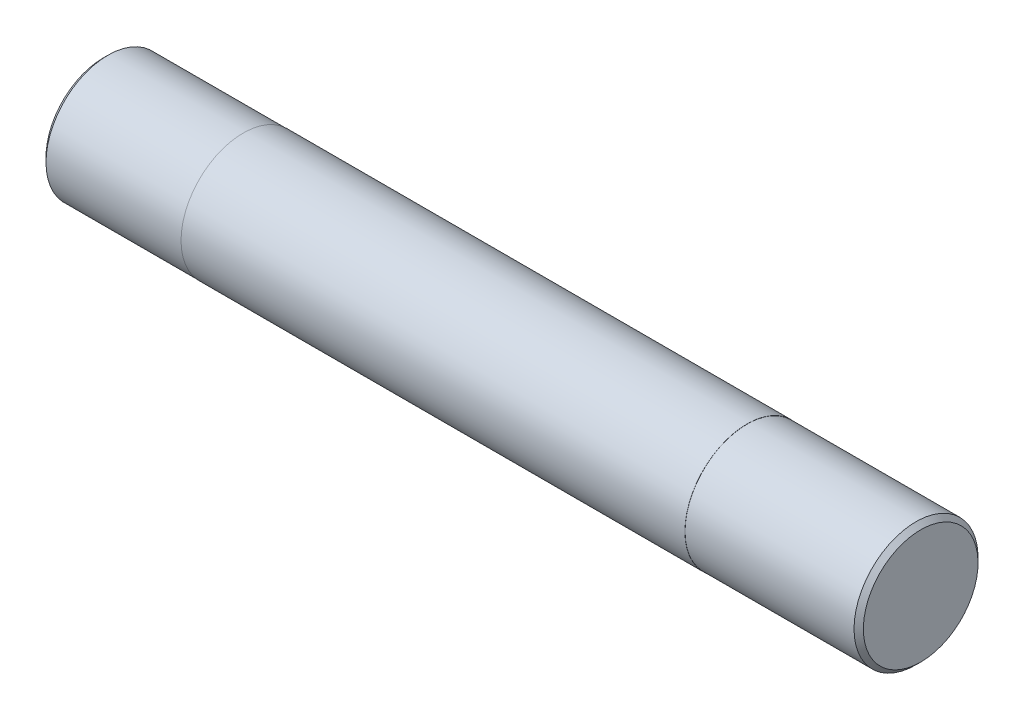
ISO-10303-21;
HEADER;
FILE_DESCRIPTION(('STEP AP214'),'2;1');
FILE_NAME('part.step','',(''),(''),'','','');
FILE_SCHEMA(('AUTOMOTIVE_DESIGN { 1 0 10303 214 1 1 1 1 }'));
ENDSEC;
DATA;
#1=APPLICATION_CONTEXT('core data for automotive mechanical design processes');
#2=APPLICATION_PROTOCOL_DEFINITION('international standard','automotive_design',2000,#1);
#3=PRODUCT_CONTEXT('',#1,'mechanical');
#4=PRODUCT('Part','Part','',(#3));
#5=PRODUCT_RELATED_PRODUCT_CATEGORY('part','',(#4));
#6=PRODUCT_DEFINITION_FORMATION('','',#4);
#7=PRODUCT_DEFINITION_CONTEXT('part definition',#1,'design');
#8=PRODUCT_DEFINITION('design','',#6,#7);
#9=PRODUCT_DEFINITION_SHAPE('','',#8);
#10=(LENGTH_UNIT() NAMED_UNIT(*) SI_UNIT(.MILLI.,.METRE.));
#11=(NAMED_UNIT(*) PLANE_ANGLE_UNIT() SI_UNIT($,.RADIAN.));
#12=(NAMED_UNIT(*) SI_UNIT($,.STERADIAN.) SOLID_ANGLE_UNIT());
#13=UNCERTAINTY_MEASURE_WITH_UNIT(LENGTH_MEASURE(1.E-05),#10,'distance_accuracy_value','');
#14=(GEOMETRIC_REPRESENTATION_CONTEXT(3) GLOBAL_UNCERTAINTY_ASSIGNED_CONTEXT((#13)) GLOBAL_UNIT_ASSIGNED_CONTEXT((#10,
#11,#12)) REPRESENTATION_CONTEXT('',''));
#15=CARTESIAN_POINT('',(0.,0.,0.));
#16=DIRECTION('',(0.,0.,1.));
#17=DIRECTION('',(1.,0.,0.));
#18=AXIS2_PLACEMENT_3D('',#15,#16,#17);
#19=CARTESIAN_POINT('',(-26.2999999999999,3.98999999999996,0.));
#20=DIRECTION('',(1.,0.,0.));
#21=DIRECTION('',(0.,0.,-1.));
#22=AXIS2_PLACEMENT_3D('',#19,#20,#21);
#23=PLANE('',#22);
#24=CARTESIAN_POINT('',(-26.2999999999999,0.,0.));
#25=DIRECTION('',(1.,0.,0.));
#26=DIRECTION('',(0.,1.,0.));
#27=AXIS2_PLACEMENT_3D('',#24,#25,#26);
#28=CIRCLE('',#27,3.68999999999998);
#29=CARTESIAN_POINT('',(-26.2999999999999,3.68999999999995,0.));
#30=VERTEX_POINT('',#29);
#31=EDGE_CURVE('E362',#30,#30,#28,.F.);
#32=ORIENTED_EDGE('',*,*,#31,.T.);
#33=EDGE_LOOP('',(#32));
#34=FACE_BOUND('',#33,.T.);
#35=ADVANCED_FACE('F356',(#34),#23,.F.);
#36=CARTESIAN_POINT('',(-19.9999999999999,0.,0.));
#37=DIRECTION('',(-1.,0.,0.));
#38=DIRECTION('',(0.,0.,1.));
#39=AXIS2_PLACEMENT_3D('',#36,#37,#38);
#40=CYLINDRICAL_SURFACE('',#39,3.98999999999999);
#41=CARTESIAN_POINT('',(-25.9999999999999,0.,0.));
#42=DIRECTION('',(1.,0.,0.));
#43=DIRECTION('',(0.,1.,0.));
#44=AXIS2_PLACEMENT_3D('',#41,#42,#43);
#45=CIRCLE('',#44,3.98999999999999);
#46=CARTESIAN_POINT('',(-25.9999999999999,3.98999999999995,0.));
#47=VERTEX_POINT('',#46);
#48=EDGE_CURVE('E12',#47,#47,#45,.T.);
#49=ORIENTED_EDGE('',*,*,#48,.T.);
#50=EDGE_LOOP('',(#49));
#51=FACE_BOUND('',#50,.T.);
#52=CARTESIAN_POINT('',(-17.3,0.,0.));
#53=DIRECTION('',(-1.,0.,0.));
#54=DIRECTION('',(0.,0.,1.));
#55=AXIS2_PLACEMENT_3D('',#52,#53,#54);
#56=CIRCLE('',#55,3.98999999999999);
#57=CARTESIAN_POINT('',(-17.3,0.,3.99000000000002));
#58=VERTEX_POINT('',#57);
#59=EDGE_CURVE('E375',#58,#58,#56,.T.);
#60=ORIENTED_EDGE('',*,*,#59,.T.);
#61=EDGE_LOOP('',(#60));
#62=FACE_BOUND('',#61,.T.);
#63=ADVANCED_FACE('F406',(#51,#62),#40,.T.);
#64=CARTESIAN_POINT('',(-17.3,3.99999999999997,0.));
#65=DIRECTION('',(1.,0.,0.));
#66=DIRECTION('',(0.,0.,-1.));
#67=AXIS2_PLACEMENT_3D('',#64,#65,#66);
#68=PLANE('',#67);
#69=ORIENTED_EDGE('',*,*,#59,.F.);
#70=EDGE_LOOP('',(#69));
#71=FACE_BOUND('',#70,.T.);
#72=CARTESIAN_POINT('',(-17.3,0.,0.));
#73=DIRECTION('',(-1.,0.,0.));
#74=DIRECTION('',(0.,0.,1.));
#75=AXIS2_PLACEMENT_3D('',#72,#73,#74);
#76=CIRCLE('',#75,4.);
#77=CARTESIAN_POINT('',(-17.3,0.,4.00000000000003));
#78=VERTEX_POINT('',#77);
#79=EDGE_CURVE('E378',#78,#78,#76,.T.);
#80=ORIENTED_EDGE('',*,*,#79,.T.);
#81=EDGE_LOOP('',(#80));
#82=FACE_BOUND('',#81,.T.);
#83=ADVANCED_FACE('F410',(#71,#82),#68,.F.);
#84=CARTESIAN_POINT('',(-19.9999999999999,0.,0.));
#85=DIRECTION('',(-1.,0.,0.));
#86=DIRECTION('',(0.,0.,1.));
#87=AXIS2_PLACEMENT_3D('',#84,#85,#86);
#88=CYLINDRICAL_SURFACE('',#87,4.);
#89=ORIENTED_EDGE('',*,*,#79,.F.);
#90=EDGE_LOOP('',(#89));
#91=FACE_BOUND('',#90,.T.);
#92=CARTESIAN_POINT('',(15.125799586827,0.,0.));
#93=DIRECTION('',(-1.,0.,0.));
#94=DIRECTION('',(0.,0.,1.));
#95=AXIS2_PLACEMENT_3D('',#92,#93,#94);
#96=CIRCLE('',#95,4.);
#97=CARTESIAN_POINT('',(15.125799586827,0.,4.00000000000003));
#98=VERTEX_POINT('',#97);
#99=EDGE_CURVE('E381',#98,#98,#96,.T.);
#100=ORIENTED_EDGE('',*,*,#99,.T.);
#101=EDGE_LOOP('',(#100));
#102=FACE_BOUND('',#101,.T.);
#103=ADVANCED_FACE('F402',(#91,#102),#88,.T.);
#104=CARTESIAN_POINT('',(15.1257344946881,0.,0.));
#105=DIRECTION('',(1.,0.,0.));
#106=DIRECTION('',(0.,0.,-1.));
#107=AXIS2_PLACEMENT_3D('',#104,#105,#106);
#108=CONICAL_SURFACE('',#107,3.99,1.56428720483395);
#109=ORIENTED_EDGE('',*,*,#99,.F.);
#110=EDGE_LOOP('',(#109));
#111=FACE_BOUND('',#110,.T.);
#112=CARTESIAN_POINT('',(15.1257344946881,0.,0.));
#113=DIRECTION('',(-1.,0.,0.));
#114=DIRECTION('',(0.,0.,1.));
#115=AXIS2_PLACEMENT_3D('',#112,#113,#114);
#116=CIRCLE('',#115,3.99);
#117=CARTESIAN_POINT('',(15.1257344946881,0.,3.99000000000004));
#118=VERTEX_POINT('',#117);
#119=EDGE_CURVE('E384',#118,#118,#116,.T.);
#120=ORIENTED_EDGE('',*,*,#119,.T.);
#121=EDGE_LOOP('',(#120));
#122=FACE_BOUND('',#121,.T.);
#123=ADVANCED_FACE('F388',(#111,#122),#108,.F.);
#124=CARTESIAN_POINT('',(-19.9999999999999,0.,0.));
#125=DIRECTION('',(-1.,0.,0.));
#126=DIRECTION('',(0.,0.,1.));
#127=AXIS2_PLACEMENT_3D('',#124,#125,#126);
#128=CYLINDRICAL_SURFACE('',#127,3.99);
#129=CARTESIAN_POINT('',(26.,0.,0.));
#130=DIRECTION('',(-1.,0.,0.));
#131=DIRECTION('',(0.,-1.,0.));
#132=AXIS2_PLACEMENT_3D('',#129,#130,#131);
#133=CIRCLE('',#132,3.99);
#134=CARTESIAN_POINT('',(26.,-3.99,0.));
#135=VERTEX_POINT('',#134);
#136=EDGE_CURVE('E370',#135,#135,#133,.T.);
#137=ORIENTED_EDGE('',*,*,#136,.T.);
#138=EDGE_LOOP('',(#137));
#139=FACE_BOUND('',#138,.T.);
#140=ORIENTED_EDGE('',*,*,#119,.F.);
#141=EDGE_LOOP('',(#140));
#142=FACE_BOUND('',#141,.T.);
#143=ADVANCED_FACE('F390',(#139,#142),#128,.T.);
#144=CARTESIAN_POINT('',(26.3,3.99000000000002,0.));
#145=DIRECTION('',(-1.,0.,0.));
#146=DIRECTION('',(0.,0.,1.));
#147=AXIS2_PLACEMENT_3D('',#144,#145,#146);
#148=PLANE('',#147);
#149=CARTESIAN_POINT('',(26.3,0.,0.));
#150=DIRECTION('',(-1.,0.,0.));
#151=DIRECTION('',(0.,-1.,0.));
#152=AXIS2_PLACEMENT_3D('',#149,#150,#151);
#153=CIRCLE('',#152,3.69);
#154=CARTESIAN_POINT('',(26.3,-3.69,0.));
#155=VERTEX_POINT('',#154);
#156=EDGE_CURVE('E366',#155,#155,#153,.F.);
#157=ORIENTED_EDGE('',*,*,#156,.T.);
#158=EDGE_LOOP('',(#157));
#159=FACE_BOUND('',#158,.T.);
#160=ADVANCED_FACE('F392',(#159),#148,.F.);
#161=CARTESIAN_POINT('',(26.,0.,0.));
#162=DIRECTION('',(-1.,0.,0.));
#163=DIRECTION('',(0.,-1.,0.));
#164=AXIS2_PLACEMENT_3D('',#161,#162,#163);
#165=CONICAL_SURFACE('',#164,3.99,0.785398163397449);
#166=ORIENTED_EDGE('',*,*,#156,.F.);
#167=EDGE_LOOP('',(#166));
#168=FACE_BOUND('',#167,.T.);
#169=ORIENTED_EDGE('',*,*,#136,.F.);
#170=EDGE_LOOP('',(#169));
#171=FACE_BOUND('',#170,.T.);
#172=ADVANCED_FACE('F399',(#168,#171),#165,.T.);
#173=CARTESIAN_POINT('',(-26.2999999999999,0.,0.));
#174=DIRECTION('',(1.,0.,0.));
#175=DIRECTION('',(0.,1.,0.));
#176=AXIS2_PLACEMENT_3D('',#173,#174,#175);
#177=CONICAL_SURFACE('',#176,3.68999999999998,0.785398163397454);
#178=ORIENTED_EDGE('',*,*,#48,.F.);
#179=EDGE_LOOP('',(#178));
#180=FACE_BOUND('',#179,.T.);
#181=ORIENTED_EDGE('',*,*,#31,.F.);
#182=EDGE_LOOP('',(#181));
#183=FACE_BOUND('',#182,.T.);
#184=ADVANCED_FACE('F437',(#180,#183),#177,.T.);
#185=CLOSED_SHELL('',(#35,#63,#83,#103,#123,#143,#160,#172,#184));
#186=MANIFOLD_SOLID_BREP('B2',#185);
#187=ADVANCED_BREP_SHAPE_REPRESENTATION('',(#18,#186),#14);
#188=SHAPE_DEFINITION_REPRESENTATION(#9,#187);
ENDSEC;
END-ISO-10303-21;
